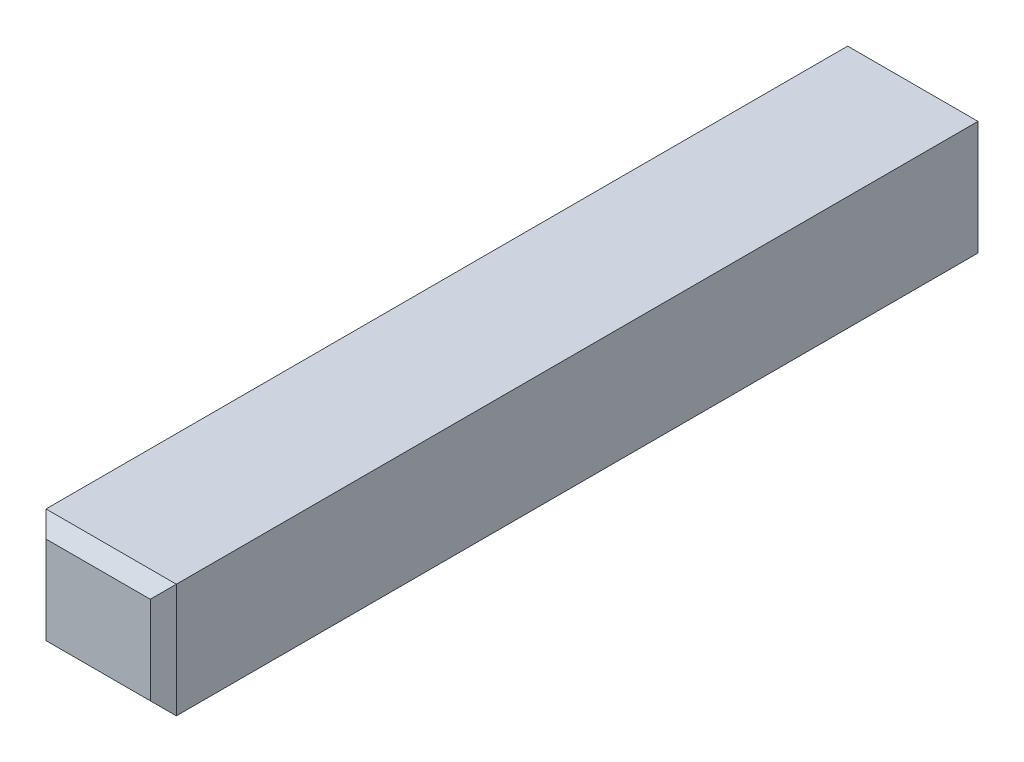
from build123d import *

# Parameters (mm, degrees)
SKETCH1_W           = 8
SKETCH1_H           = 7
BOSS_EXTRUDE1_DEPTH = 25
CHAMFER1_SIZE       = 0.8


with BuildPart() as part:
    # Sketch1 → Boss-Extrude1 (new, symmetric)
    with BuildSketch(Plane.XY):
        Rectangle(SKETCH1_W, SKETCH1_H)
    extrude(amount=BOSS_EXTRUDE1_DEPTH, both=True)

    # Chamfer1
    chamfer1_edges = [part.edges().sort_by_distance(p)[0] for p in [
        (-4, 0, 25),
        (0, -3.5, 25),
        (4, 0, 25),
        (0, 3.5, 25),
    ]]
    chamfer(chamfer1_edges, length=CHAMFER1_SIZE)


solid = part.part
